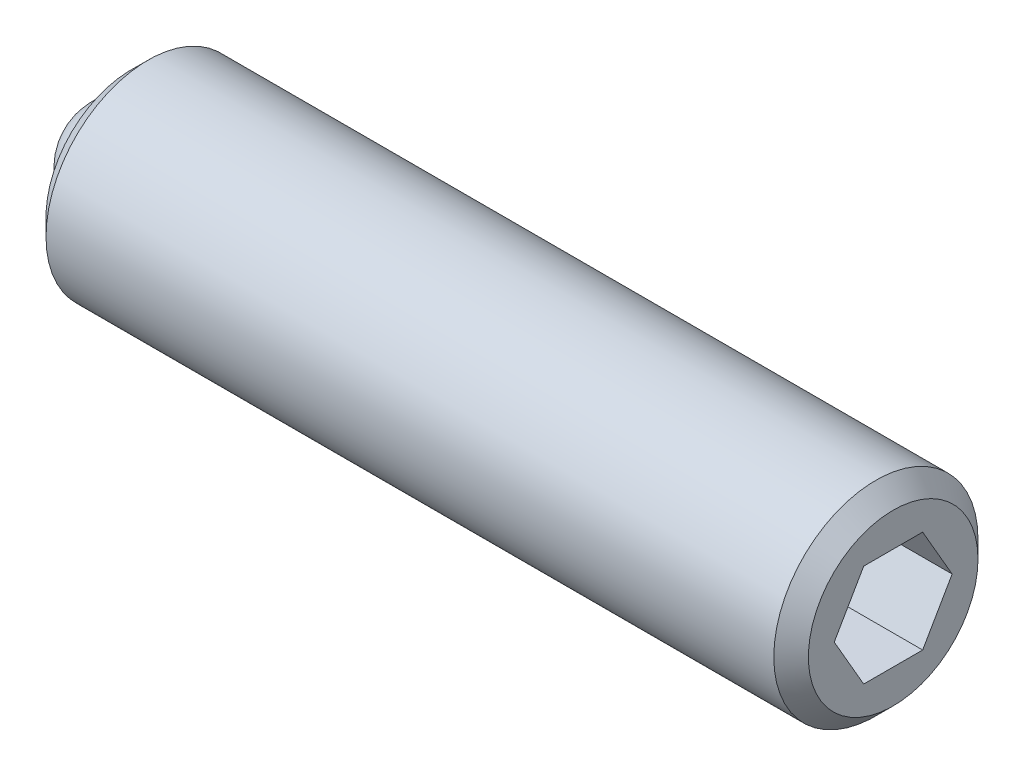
from build123d import *

# Parameters (mm, degrees)
SKETCH2_R           = 1.5
BOSS_EXTRUDE1_DEPTH = 11.2
CHAMFER1_SIZE       = 0.254
CHAMFER2_SIZE       = 0.254
CUT_EXTRUDE2_DEPTH  = 2
SKETCH3_R           = 0.8
CUT_EXTRUDE3_DEPTH  = 0.8
CUT_EXTRUDE4_DEPTH  = 0.8


with BuildPart() as part:
    # Sketch2 → Boss-Extrude1 (new body)
    with BuildSketch(Plane(origin=(0, 0, 0), x_dir=(0, 0, -1), z_dir=(1, 0, 0))):
        Circle(SKETCH2_R)
    extrude(amount=BOSS_EXTRUDE1_DEPTH)

    # Chamfer1
    chamfer1_edges = [part.edges().sort_by_distance(p)[0] for p in [
        (0, 0, 1.5),
    ]]
    chamfer(chamfer1_edges, length=CHAMFER1_SIZE)

    # Chamfer2
    chamfer2_edges = [part.edges().sort_by_distance(p)[0] for p in [
        (11.2, 0, 1.5),
    ]]
    chamfer(chamfer2_edges, length=CHAMFER2_SIZE)

    # Sketch4 → Cut-Extrude2 (cut)
    with BuildSketch(Plane(origin=(11.2, 0, 0), x_dir=(0, 0, -1), z_dir=(1, 0, 0))):
        Polygon((0.866025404, 0), (0.433012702, 0.75), (-0.433012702, 0.75), (-0.866025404, 0), (-0.433012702, -0.75), (0.433012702, -0.75), align=None)
    extrude(amount=-CUT_EXTRUDE2_DEPTH, mode=Mode.SUBTRACT)

    # Sketch3 → Cut-Extrude3 (cut)
    with BuildSketch(Plane.ZY):
        Circle(SKETCH3_R)
    extrude(amount=-CUT_EXTRUDE3_DEPTH, mode=Mode.SUBTRACT)

    # Sketch7 → Cut-Extrude4 (cut)
    with BuildSketch(Plane.ZY):
        with BuildLine():
            ThreePointArc((0.063449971, 0.797479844), (0, 0.8), (-0.063449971, 0.797479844))
            ThreePointArc((-0.063449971, 0.797479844), (0, 0.8635), (0.063449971, 0.797479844))
        make_face()
    extrude(amount=-CUT_EXTRUDE4_DEPTH, mode=Mode.SUBTRACT)


with BuildPart() as body_2:
    # Sketch5 → Revolve1 (revolve)
    with BuildSketch(Plane.ZY):
        with BuildLine():
            Line((0, 0), (0, -0.8))
            ThreePointArc((0, -0.8), (-0.8, 0), (0, 0.8))
            Line((0, 0.8), (0, 0))
        make_face()
    revolve(axis=Axis((0, 0, 0), (0, 1, 0)))


solid = Compound([part.part, body_2.part])
